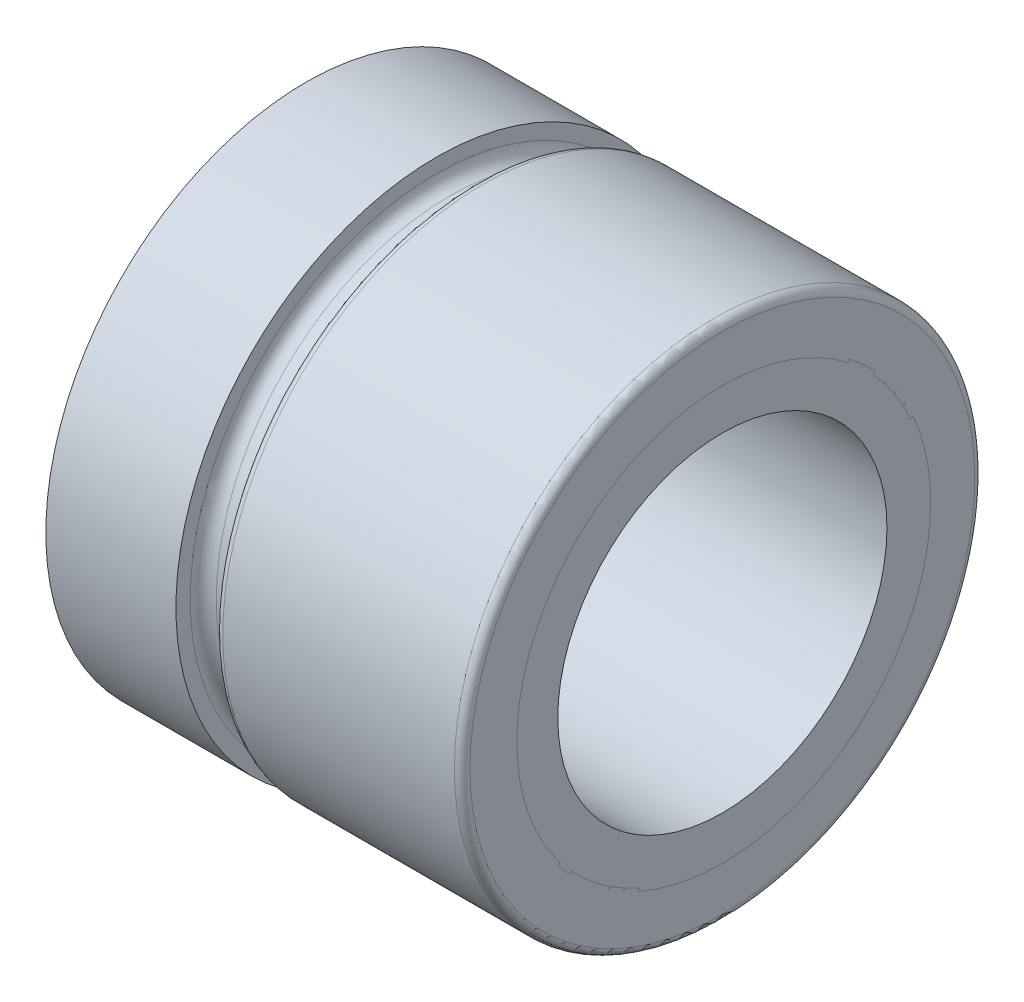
ISO-10303-21;
HEADER;
FILE_DESCRIPTION(('STEP AP214'),'2;1');
FILE_NAME('part.step','',(''),(''),'','','');
FILE_SCHEMA(('AUTOMOTIVE_DESIGN { 1 0 10303 214 1 1 1 1 }'));
ENDSEC;
DATA;
#1=APPLICATION_CONTEXT('core data for automotive mechanical design processes');
#2=APPLICATION_PROTOCOL_DEFINITION('international standard','automotive_design',2000,#1);
#3=PRODUCT_CONTEXT('',#1,'mechanical');
#4=PRODUCT('Part','Part','',(#3));
#5=PRODUCT_RELATED_PRODUCT_CATEGORY('part','',(#4));
#6=PRODUCT_DEFINITION_FORMATION('','',#4);
#7=PRODUCT_DEFINITION_CONTEXT('part definition',#1,'design');
#8=PRODUCT_DEFINITION('design','',#6,#7);
#9=PRODUCT_DEFINITION_SHAPE('','',#8);
#10=(LENGTH_UNIT() NAMED_UNIT(*) SI_UNIT(.MILLI.,.METRE.));
#11=(NAMED_UNIT(*) PLANE_ANGLE_UNIT() SI_UNIT($,.RADIAN.));
#12=(NAMED_UNIT(*) SI_UNIT($,.STERADIAN.) SOLID_ANGLE_UNIT());
#13=UNCERTAINTY_MEASURE_WITH_UNIT(LENGTH_MEASURE(1.E-05),#10,'distance_accuracy_value','');
#14=(GEOMETRIC_REPRESENTATION_CONTEXT(3) GLOBAL_UNCERTAINTY_ASSIGNED_CONTEXT((#13)) GLOBAL_UNIT_ASSIGNED_CONTEXT((#10,
#11,#12)) REPRESENTATION_CONTEXT('',''));
#15=CARTESIAN_POINT('',(0.,0.,0.));
#16=DIRECTION('',(0.,0.,1.));
#17=DIRECTION('',(1.,0.,0.));
#18=AXIS2_PLACEMENT_3D('',#15,#16,#17);
#19=CARTESIAN_POINT('',(-2.17640284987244,0.,0.));
#20=DIRECTION('',(1.,0.,0.));
#21=DIRECTION('',(0.,0.,-1.));
#22=AXIS2_PLACEMENT_3D('',#19,#20,#21);
#23=TOROIDAL_SURFACE('',#22,2.5102130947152,0.254);
#24=CARTESIAN_POINT('',(-2.20515646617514,0.,0.));
#25=DIRECTION('',(-1.,0.,0.));
#26=DIRECTION('',(0.,0.,1.));
#27=AXIS2_PLACEMENT_3D('',#24,#25,#26);
#28=CIRCLE('',#27,2.25784584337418);
#29=CARTESIAN_POINT('',(-2.20515646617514,0.,2.25784584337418));
#30=VERTEX_POINT('',#29);
#31=EDGE_CURVE('P0_E165',#30,#30,#28,.F.);
#32=ORIENTED_EDGE('',*,*,#31,.T.);
#33=EDGE_LOOP('',(#32));
#34=FACE_BOUND('',#33,.T.);
#35=CARTESIAN_POINT('',(-2.35600797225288,0.,0.));
#36=DIRECTION('',(-1.,0.,0.));
#37=DIRECTION('',(0.,0.,1.));
#38=AXIS2_PLACEMENT_3D('',#35,#36,#37);
#39=CIRCLE('',#38,2.33060797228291);
#40=CARTESIAN_POINT('',(-2.35600797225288,0.,2.33060797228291));
#41=VERTEX_POINT('',#40);
#42=EDGE_CURVE('P0_E161',#41,#41,#39,.T.);
#43=ORIENTED_EDGE('',*,*,#42,.T.);
#44=EDGE_LOOP('',(#43));
#45=FACE_BOUND('',#44,.T.);
#46=ADVANCED_FACE('P0_F16',(#34,#45),#23,.T.);
#47=CARTESIAN_POINT('',(-2.20515646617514,0.,0.));
#48=DIRECTION('',(-1.,0.,0.));
#49=DIRECTION('',(0.,0.,1.));
#50=AXIS2_PLACEMENT_3D('',#47,#48,#49);
#51=CONICAL_SURFACE('',#50,2.25784584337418,0.113446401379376);
#52=ORIENTED_EDGE('',*,*,#31,.F.);
#53=EDGE_LOOP('',(#52));
#54=FACE_BOUND('',#53,.T.);
#55=CARTESIAN_POINT('',(0.,0.,0.));
#56=DIRECTION('',(-1.,0.,0.));
#57=DIRECTION('',(0.,0.,1.));
#58=AXIS2_PLACEMENT_3D('',#55,#56,#57);
#59=CIRCLE('',#58,2.00660000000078);
#60=CARTESIAN_POINT('',(0.,0.,2.00660000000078));
#61=VERTEX_POINT('',#60);
#62=EDGE_CURVE('P0_E157',#61,#61,#59,.T.);
#63=ORIENTED_EDGE('',*,*,#62,.F.);
#64=EDGE_LOOP('',(#63));
#65=FACE_BOUND('',#64,.T.);
#66=ADVANCED_FACE('P0_F129',(#54,#65),#51,.F.);
#67=CARTESIAN_POINT('',(-2.41299999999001,0.,0.));
#68=DIRECTION('',(-1.,0.,0.));
#69=DIRECTION('',(0.,0.,1.));
#70=AXIS2_PLACEMENT_3D('',#67,#68,#69);
#71=CONICAL_SURFACE('',#70,2.38760000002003,0.785398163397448);
#72=CARTESIAN_POINT('',(-2.41299999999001,0.,0.));
#73=DIRECTION('',(-1.,0.,0.));
#74=DIRECTION('',(0.,0.,1.));
#75=AXIS2_PLACEMENT_3D('',#72,#73,#74);
#76=CIRCLE('',#75,2.38760000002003);
#77=CARTESIAN_POINT('',(-2.41299999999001,0.,2.38760000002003));
#78=VERTEX_POINT('',#77);
#79=EDGE_CURVE('P0_E54',#78,#78,#76,.F.);
#80=ORIENTED_EDGE('',*,*,#79,.F.);
#81=EDGE_LOOP('',(#80));
#82=FACE_BOUND('',#81,.T.);
#83=ORIENTED_EDGE('',*,*,#42,.F.);
#84=EDGE_LOOP('',(#83));
#85=FACE_BOUND('',#84,.T.);
#86=ADVANCED_FACE('P0_F125',(#82,#85),#71,.F.);
#87=CARTESIAN_POINT('',(0.,-2.54,0.));
#88=DIRECTION('',(1.,0.,0.));
#89=DIRECTION('',(0.,0.,-1.));
#90=AXIS2_PLACEMENT_3D('',#87,#88,#89);
#91=PLANE('',#90);
#92=ORIENTED_EDGE('',*,*,#62,.T.);
#93=EDGE_LOOP('',(#92));
#94=FACE_BOUND('',#93,.T.);
#95=CARTESIAN_POINT('',(0.,0.,0.));
#96=DIRECTION('',(-1.,0.,0.));
#97=DIRECTION('',(0.,0.,1.));
#98=AXIS2_PLACEMENT_3D('',#95,#96,#97);
#99=CIRCLE('',#98,2.4638);
#100=CARTESIAN_POINT('',(0.,0.,2.4638));
#101=VERTEX_POINT('',#100);
#102=CARTESIAN_POINT('',(0.,0.,-2.4638));
#103=VERTEX_POINT('',#102);
#104=EDGE_CURVE('P0_E51',#101,#103,#99,.T.);
#105=ORIENTED_EDGE('',*,*,#104,.F.);
#106=CARTESIAN_POINT('',(0.,0.,0.));
#107=DIRECTION('',(-1.,0.,0.));
#108=DIRECTION('',(0.,0.,-1.));
#109=AXIS2_PLACEMENT_3D('',#106,#107,#108);
#110=CIRCLE('',#109,2.4638);
#111=EDGE_CURVE('P0_E46',#103,#101,#110,.T.);
#112=ORIENTED_EDGE('',*,*,#111,.F.);
#113=EDGE_LOOP('',(#105,#112));
#114=FACE_BOUND('',#113,.T.);
#115=ADVANCED_FACE('P0_F50',(#94,#114),#91,.T.);
#116=CARTESIAN_POINT('',(-2.41300000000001,-2.3876,0.));
#117=DIRECTION('',(-1.,0.,0.));
#118=DIRECTION('',(0.,0.,1.));
#119=AXIS2_PLACEMENT_3D('',#116,#117,#118);
#120=PLANE('',#119);
#121=ORIENTED_EDGE('',*,*,#79,.T.);
#122=EDGE_LOOP('',(#121));
#123=FACE_BOUND('',#122,.T.);
#124=CARTESIAN_POINT('',(-2.41300000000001,0.,0.));
#125=DIRECTION('',(1.,0.,0.));
#126=DIRECTION('',(0.,0.,-1.));
#127=AXIS2_PLACEMENT_3D('',#124,#125,#126);
#128=CIRCLE('',#127,2.4638);
#129=CARTESIAN_POINT('',(-2.41300000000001,0.,-2.4638));
#130=VERTEX_POINT('',#129);
#131=CARTESIAN_POINT('',(-2.41300000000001,0.,2.4638));
#132=VERTEX_POINT('',#131);
#133=EDGE_CURVE('P0_E61',#130,#132,#128,.T.);
#134=ORIENTED_EDGE('',*,*,#133,.F.);
#135=CARTESIAN_POINT('',(-2.41300000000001,0.,0.));
#136=DIRECTION('',(1.,0.,0.));
#137=DIRECTION('',(0.,0.,1.));
#138=AXIS2_PLACEMENT_3D('',#135,#136,#137);
#139=CIRCLE('',#138,2.4638);
#140=EDGE_CURVE('P0_E37',#132,#130,#139,.T.);
#141=ORIENTED_EDGE('',*,*,#140,.F.);
#142=EDGE_LOOP('',(#134,#141));
#143=FACE_BOUND('',#142,.T.);
#144=ADVANCED_FACE('P0_F80',(#123,#143),#120,.T.);
#145=CARTESIAN_POINT('',(-0.0762000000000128,0.,0.));
#146=DIRECTION('',(1.,0.,0.));
#147=DIRECTION('',(0.,0.,-1.));
#148=AXIS2_PLACEMENT_3D('',#145,#146,#147);
#149=TOROIDAL_SURFACE('',#148,2.4638,0.0762);
#150=ORIENTED_EDGE('',*,*,#111,.T.);
#151=ORIENTED_EDGE('',*,*,#104,.T.);
#152=EDGE_LOOP('',(#150,#151));
#153=FACE_BOUND('',#152,.T.);
#154=CARTESIAN_POINT('',(-0.0762000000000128,0.,0.));
#155=DIRECTION('',(-1.,0.,0.));
#156=DIRECTION('',(0.,0.,1.));
#157=AXIS2_PLACEMENT_3D('',#154,#155,#156);
#158=CIRCLE('',#157,2.54);
#159=CARTESIAN_POINT('',(-0.0762000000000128,0.,2.54));
#160=VERTEX_POINT('',#159);
#161=EDGE_CURVE('P0_E29',#160,#160,#158,.T.);
#162=ORIENTED_EDGE('',*,*,#161,.F.);
#163=EDGE_LOOP('',(#162));
#164=FACE_BOUND('',#163,.T.);
#165=ADVANCED_FACE('P0_F58',(#153,#164),#149,.T.);
#166=CARTESIAN_POINT('',(-2.33680000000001,0.,0.));
#167=DIRECTION('',(-1.,0.,0.));
#168=DIRECTION('',(0.,0.,1.));
#169=AXIS2_PLACEMENT_3D('',#166,#167,#168);
#170=TOROIDAL_SURFACE('',#169,2.4638,0.0762);
#171=ORIENTED_EDGE('',*,*,#140,.T.);
#172=ORIENTED_EDGE('',*,*,#133,.T.);
#173=EDGE_LOOP('',(#171,#172));
#174=FACE_BOUND('',#173,.T.);
#175=CARTESIAN_POINT('',(-2.33680000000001,0.,0.));
#176=DIRECTION('',(-1.,0.,0.));
#177=DIRECTION('',(0.,0.,1.));
#178=AXIS2_PLACEMENT_3D('',#175,#176,#177);
#179=CIRCLE('',#178,2.54);
#180=CARTESIAN_POINT('',(-2.33680000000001,0.,2.54));
#181=VERTEX_POINT('',#180);
#182=EDGE_CURVE('P0_E11',#181,#181,#179,.F.);
#183=ORIENTED_EDGE('',*,*,#182,.F.);
#184=EDGE_LOOP('',(#183));
#185=FACE_BOUND('',#184,.T.);
#186=ADVANCED_FACE('P0_F79',(#174,#185),#170,.T.);
#187=CARTESIAN_POINT('',(-2.41300000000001,0.,0.));
#188=DIRECTION('',(-1.,0.,0.));
#189=DIRECTION('',(0.,0.,1.));
#190=AXIS2_PLACEMENT_3D('',#187,#188,#189);
#191=CYLINDRICAL_SURFACE('',#190,2.54);
#192=ORIENTED_EDGE('',*,*,#182,.T.);
#193=EDGE_LOOP('',(#192));
#194=FACE_BOUND('',#193,.T.);
#195=ORIENTED_EDGE('',*,*,#161,.T.);
#196=EDGE_LOOP('',(#195));
#197=FACE_BOUND('',#196,.T.);
#198=ADVANCED_FACE('P0_F139',(#194,#197),#191,.T.);
#199=CLOSED_SHELL('',(#46,#66,#86,#115,#144,#165,#186,#198));
#200=MANIFOLD_SOLID_BREP('P0_B1',#199);
#201=CARTESIAN_POINT('',(-2.66699999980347,0.,0.));
#202=DIRECTION('',(-1.,0.,0.));
#203=DIRECTION('',(0.,0.,1.));
#204=AXIS2_PLACEMENT_3D('',#201,#202,#203);
#205=CONICAL_SURFACE('',#204,2.27329999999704,0.016665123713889);
#206=CARTESIAN_POINT('',(-0.381000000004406,0.,0.));
#207=DIRECTION('',(-1.,0.,0.));
#208=DIRECTION('',(0.,0.,1.));
#209=AXIS2_PLACEMENT_3D('',#206,#207,#208);
#210=CIRCLE('',#209,2.23520000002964);
#211=CARTESIAN_POINT('',(-0.381000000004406,0.,2.23520000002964));
#212=VERTEX_POINT('',#211);
#213=EDGE_CURVE('P1_E49',#212,#212,#210,.F.);
#214=ORIENTED_EDGE('',*,*,#213,.F.);
#215=EDGE_LOOP('',(#214));
#216=FACE_BOUND('',#215,.T.);
#217=CARTESIAN_POINT('',(-2.667,0.,0.));
#218=DIRECTION('',(1.,0.,0.));
#219=DIRECTION('',(0.,0.,-1.));
#220=AXIS2_PLACEMENT_3D('',#217,#218,#219);
#221=CIRCLE('',#220,2.2733);
#222=CARTESIAN_POINT('',(-2.667,0.,-2.2733));
#223=VERTEX_POINT('',#222);
#224=EDGE_CURVE('P1_E66',#223,#223,#221,.T.);
#225=ORIENTED_EDGE('',*,*,#224,.T.);
#226=EDGE_LOOP('',(#225));
#227=FACE_BOUND('',#226,.T.);
#228=ADVANCED_FACE('P1_F16',(#216,#227),#205,.T.);
#229=CARTESIAN_POINT('',(-2.667,0.,0.));
#230=DIRECTION('',(1.,0.,0.));
#231=DIRECTION('',(0.,0.,-1.));
#232=AXIS2_PLACEMENT_3D('',#229,#230,#231);
#233=TOROIDAL_SURFACE('',#232,2.4003,0.127);
#234=CARTESIAN_POINT('',(-2.794,0.,0.));
#235=DIRECTION('',(1.,0.,0.));
#236=DIRECTION('',(0.,0.,1.));
#237=AXIS2_PLACEMENT_3D('',#234,#235,#236);
#238=CIRCLE('',#237,2.4003);
#239=CARTESIAN_POINT('',(-2.794,0.,-2.4003));
#240=VERTEX_POINT('',#239);
#241=CARTESIAN_POINT('',(-2.794,0.,2.4003));
#242=VERTEX_POINT('',#241);
#243=EDGE_CURVE('P1_E36',#240,#242,#238,.F.);
#244=ORIENTED_EDGE('',*,*,#243,.F.);
#245=CARTESIAN_POINT('',(-2.794,0.,0.));
#246=DIRECTION('',(1.,0.,0.));
#247=DIRECTION('',(0.,0.,-1.));
#248=AXIS2_PLACEMENT_3D('',#245,#246,#247);
#249=CIRCLE('',#248,2.4003);
#250=EDGE_CURVE('P1_E33',#242,#240,#249,.F.);
#251=ORIENTED_EDGE('',*,*,#250,.F.);
#252=EDGE_LOOP('',(#244,#251));
#253=FACE_BOUND('',#252,.T.);
#254=ORIENTED_EDGE('',*,*,#224,.F.);
#255=EDGE_LOOP('',(#254));
#256=FACE_BOUND('',#255,.T.);
#257=ADVANCED_FACE('P1_F46',(#253,#256),#233,.F.);
#258=CARTESIAN_POINT('',(-0.380999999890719,0.,0.));
#259=DIRECTION('',(-1.,0.,0.));
#260=DIRECTION('',(0.,0.,1.));
#261=AXIS2_PLACEMENT_3D('',#258,#259,#260);
#262=CONICAL_SURFACE('',#261,2.23519999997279,0.349065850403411);
#263=CARTESIAN_POINT('',(-0.0807869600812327,0.,0.));
#264=DIRECTION('',(1.,0.,0.));
#265=DIRECTION('',(0.,0.,-1.));
#266=AXIS2_PLACEMENT_3D('',#263,#264,#265);
#267=CIRCLE('',#266,2.12593138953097);
#268=CARTESIAN_POINT('',(-0.0807869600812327,0.,-2.12593138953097));
#269=VERTEX_POINT('',#268);
#270=EDGE_CURVE('P1_E43',#269,#269,#267,.T.);
#271=ORIENTED_EDGE('',*,*,#270,.F.);
#272=EDGE_LOOP('',(#271));
#273=FACE_BOUND('',#272,.T.);
#274=ORIENTED_EDGE('',*,*,#213,.T.);
#275=EDGE_LOOP('',(#274));
#276=FACE_BOUND('',#275,.T.);
#277=ADVANCED_FACE('P1_F84',(#273,#276),#262,.T.);
#278=CARTESIAN_POINT('',(-2.794,2.54,0.));
#279=DIRECTION('',(1.,0.,0.));
#280=DIRECTION('',(0.,0.,-1.));
#281=AXIS2_PLACEMENT_3D('',#278,#279,#280);
#282=PLANE('',#281);
#283=ORIENTED_EDGE('',*,*,#250,.T.);
#284=ORIENTED_EDGE('',*,*,#243,.T.);
#285=EDGE_LOOP('',(#283,#284));
#286=FACE_BOUND('',#285,.T.);
#287=CARTESIAN_POINT('',(-2.794,0.,0.));
#288=DIRECTION('',(1.,0.,0.));
#289=DIRECTION('',(0.,0.,-1.));
#290=AXIS2_PLACEMENT_3D('',#287,#288,#289);
#291=CIRCLE('',#290,2.54);
#292=CARTESIAN_POINT('',(-2.794,0.,-2.54));
#293=VERTEX_POINT('',#292);
#294=EDGE_CURVE('P1_E51',#293,#293,#291,.F.);
#295=ORIENTED_EDGE('',*,*,#294,.F.);
#296=EDGE_LOOP('',(#295));
#297=FACE_BOUND('',#296,.T.);
#298=ADVANCED_FACE('P1_F38',(#286,#297),#282,.T.);
#299=CARTESIAN_POINT('',(-0.124223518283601,0.,0.));
#300=DIRECTION('',(1.,0.,0.));
#301=DIRECTION('',(0.,0.,-1.));
#302=AXIS2_PLACEMENT_3D('',#299,#300,#301);
#303=TOROIDAL_SURFACE('',#302,2.00659042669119,0.126999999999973);
#304=ORIENTED_EDGE('',*,*,#270,.T.);
#305=EDGE_LOOP('',(#304));
#306=FACE_BOUND('',#305,.T.);
#307=CARTESIAN_POINT('',(0.,0.,0.));
#308=DIRECTION('',(1.,0.,0.));
#309=DIRECTION('',(0.,0.,-1.));
#310=AXIS2_PLACEMENT_3D('',#307,#308,#309);
#311=CIRCLE('',#310,2.03300098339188);
#312=CARTESIAN_POINT('',(0.,0.,-2.03300098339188));
#313=VERTEX_POINT('',#312);
#314=EDGE_CURVE('P1_E55',#313,#313,#311,.T.);
#315=ORIENTED_EDGE('',*,*,#314,.F.);
#316=EDGE_LOOP('',(#315));
#317=FACE_BOUND('',#316,.T.);
#318=ADVANCED_FACE('P1_F101',(#306,#317),#303,.T.);
#319=CARTESIAN_POINT('',(0.,0.,0.));
#320=DIRECTION('',(1.,0.,0.));
#321=DIRECTION('',(0.,0.,-1.));
#322=AXIS2_PLACEMENT_3D('',#319,#320,#321);
#323=CYLINDRICAL_SURFACE('',#322,2.54);
#324=CARTESIAN_POINT('',(-4.064,0.,0.));
#325=DIRECTION('',(1.,0.,0.));
#326=DIRECTION('',(0.,0.,-1.));
#327=AXIS2_PLACEMENT_3D('',#324,#325,#326);
#328=CIRCLE('',#327,2.54);
#329=CARTESIAN_POINT('',(-4.064,0.,-2.54));
#330=VERTEX_POINT('',#329);
#331=EDGE_CURVE('P1_E59',#330,#330,#328,.F.);
#332=ORIENTED_EDGE('',*,*,#331,.F.);
#333=EDGE_LOOP('',(#332));
#334=FACE_BOUND('',#333,.T.);
#335=ORIENTED_EDGE('',*,*,#294,.T.);
#336=EDGE_LOOP('',(#335));
#337=FACE_BOUND('',#336,.T.);
#338=ADVANCED_FACE('P1_F114',(#334,#337),#323,.T.);
#339=CARTESIAN_POINT('',(0.,2.03300098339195,0.));
#340=DIRECTION('',(1.,0.,0.));
#341=DIRECTION('',(0.,0.,-1.));
#342=AXIS2_PLACEMENT_3D('',#339,#340,#341);
#343=PLANE('',#342);
#344=CARTESIAN_POINT('',(0.,0.,0.));
#345=DIRECTION('',(1.,0.,0.));
#346=DIRECTION('',(0.,0.,-1.));
#347=AXIS2_PLACEMENT_3D('',#344,#345,#346);
#348=CIRCLE('',#347,1.60655);
#349=CARTESIAN_POINT('',(0.,0.,-1.60655));
#350=VERTEX_POINT('',#349);
#351=EDGE_CURVE('P1_E26',#350,#350,#348,.F.);
#352=ORIENTED_EDGE('',*,*,#351,.T.);
#353=EDGE_LOOP('',(#352));
#354=FACE_BOUND('',#353,.T.);
#355=ORIENTED_EDGE('',*,*,#314,.T.);
#356=EDGE_LOOP('',(#355));
#357=FACE_BOUND('',#356,.T.);
#358=ADVANCED_FACE('P1_F118',(#354,#357),#343,.T.);
#359=CARTESIAN_POINT('',(-4.064,1.60655,0.));
#360=DIRECTION('',(-1.,0.,0.));
#361=DIRECTION('',(0.,0.,1.));
#362=AXIS2_PLACEMENT_3D('',#359,#360,#361);
#363=PLANE('',#362);
#364=ORIENTED_EDGE('',*,*,#331,.T.);
#365=EDGE_LOOP('',(#364));
#366=FACE_BOUND('',#365,.T.);
#367=CARTESIAN_POINT('',(-4.064,0.,0.));
#368=DIRECTION('',(1.,0.,0.));
#369=DIRECTION('',(0.,0.,-1.));
#370=AXIS2_PLACEMENT_3D('',#367,#368,#369);
#371=CIRCLE('',#370,1.60655);
#372=CARTESIAN_POINT('',(-4.064,0.,-1.60655));
#373=VERTEX_POINT('',#372);
#374=EDGE_CURVE('P1_E11',#373,#373,#371,.T.);
#375=ORIENTED_EDGE('',*,*,#374,.T.);
#376=EDGE_LOOP('',(#375));
#377=FACE_BOUND('',#376,.T.);
#378=ADVANCED_FACE('P1_F122',(#366,#377),#363,.T.);
#379=CARTESIAN_POINT('',(0.,0.,0.));
#380=DIRECTION('',(1.,0.,0.));
#381=DIRECTION('',(0.,0.,-1.));
#382=AXIS2_PLACEMENT_3D('',#379,#380,#381);
#383=CYLINDRICAL_SURFACE('',#382,1.60655);
#384=ORIENTED_EDGE('',*,*,#351,.F.);
#385=EDGE_LOOP('',(#384));
#386=FACE_BOUND('',#385,.T.);
#387=ORIENTED_EDGE('',*,*,#374,.F.);
#388=EDGE_LOOP('',(#387));
#389=FACE_BOUND('',#388,.T.);
#390=ADVANCED_FACE('P1_F126',(#386,#389),#383,.F.);
#391=CLOSED_SHELL('',(#228,#257,#277,#298,#318,#338,#358,#378,#390));
#392=MANIFOLD_SOLID_BREP('P1_B1',#391);
#393=ADVANCED_BREP_SHAPE_REPRESENTATION('',(#18,#200,#392),#14);
#394=SHAPE_DEFINITION_REPRESENTATION(#9,#393);
ENDSEC;
END-ISO-10303-21;
